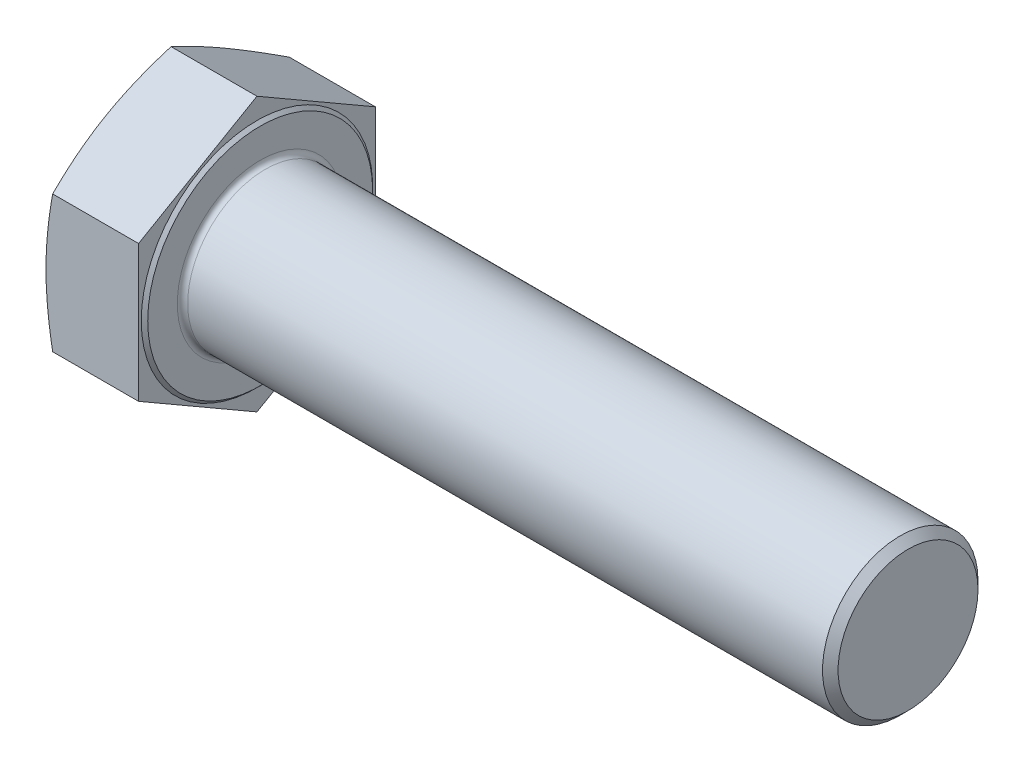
ISO-10303-21;
HEADER;
FILE_DESCRIPTION(('STEP AP214'),'2;1');
FILE_NAME('part.step','',(''),(''),'','','');
FILE_SCHEMA(('AUTOMOTIVE_DESIGN { 1 0 10303 214 1 1 1 1 }'));
ENDSEC;
DATA;
#1=APPLICATION_CONTEXT('core data for automotive mechanical design processes');
#2=APPLICATION_PROTOCOL_DEFINITION('international standard','automotive_design',2000,#1);
#3=PRODUCT_CONTEXT('',#1,'mechanical');
#4=PRODUCT('Part','Part','',(#3));
#5=PRODUCT_RELATED_PRODUCT_CATEGORY('part','',(#4));
#6=PRODUCT_DEFINITION_FORMATION('','',#4);
#7=PRODUCT_DEFINITION_CONTEXT('part definition',#1,'design');
#8=PRODUCT_DEFINITION('design','',#6,#7);
#9=PRODUCT_DEFINITION_SHAPE('','',#8);
#10=(LENGTH_UNIT() NAMED_UNIT(*) SI_UNIT(.MILLI.,.METRE.));
#11=(NAMED_UNIT(*) PLANE_ANGLE_UNIT() SI_UNIT($,.RADIAN.));
#12=(NAMED_UNIT(*) SI_UNIT($,.STERADIAN.) SOLID_ANGLE_UNIT());
#13=UNCERTAINTY_MEASURE_WITH_UNIT(LENGTH_MEASURE(1.E-05),#10,'distance_accuracy_value','');
#14=(GEOMETRIC_REPRESENTATION_CONTEXT(3) GLOBAL_UNCERTAINTY_ASSIGNED_CONTEXT((#13)) GLOBAL_UNIT_ASSIGNED_CONTEXT((#10,
#11,#12)) REPRESENTATION_CONTEXT('',''));
#15=CARTESIAN_POINT('',(0.,0.,0.));
#16=DIRECTION('',(0.,0.,1.));
#17=DIRECTION('',(1.,0.,0.));
#18=AXIS2_PLACEMENT_3D('',#15,#16,#17);
#19=CARTESIAN_POINT('',(29.58,-42.2043046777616,0.));
#20=DIRECTION('',(1.,0.,0.));
#21=DIRECTION('',(0.,0.,-1.));
#22=AXIS2_PLACEMENT_3D('',#19,#20,#21);
#23=PLANE('',#22);
#24=CARTESIAN_POINT('',(29.58,0.,0.));
#25=DIRECTION('',(1.,0.,0.));
#26=DIRECTION('',(0.,0.,-1.));
#27=AXIS2_PLACEMENT_3D('',#24,#25,#26);
#28=CIRCLE('',#27,25.6);
#29=CARTESIAN_POINT('',(29.58,0.,-25.6));
#30=VERTEX_POINT('',#29);
#31=EDGE_CURVE('E11',#30,#30,#28,.F.);
#32=ORIENTED_EDGE('',*,*,#31,.T.);
#33=EDGE_LOOP('',(#32));
#34=FACE_BOUND('',#33,.T.);
#35=CARTESIAN_POINT('',(29.58,0.,0.));
#36=DIRECTION('',(-1.,0.,0.));
#37=DIRECTION('',(0.,0.,1.));
#38=AXIS2_PLACEMENT_3D('',#35,#36,#37);
#39=CIRCLE('',#38,34.725);
#40=CARTESIAN_POINT('',(29.58,0.,34.725));
#41=VERTEX_POINT('',#40);
#42=EDGE_CURVE('E263',#41,#41,#39,.T.);
#43=ORIENTED_EDGE('',*,*,#42,.F.);
#44=EDGE_LOOP('',(#43));
#45=FACE_BOUND('',#44,.T.);
#46=ADVANCED_FACE('F32',(#34,#45),#23,.T.);
#47=CARTESIAN_POINT('',(29.58,-21.1021523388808,36.55));
#48=DIRECTION('',(0.,0.866025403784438,-0.5));
#49=DIRECTION('',(0.,0.5,0.866025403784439));
#50=AXIS2_PLACEMENT_3D('',#47,#48,#49);
#51=PLANE('',#50);
#52=CARTESIAN_POINT('',(2.05804062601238,-42.2044201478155,-0.000199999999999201));
#53=CARTESIAN_POINT('',(1.89899165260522,-41.7674273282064,0.756693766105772));
#54=CARTESIAN_POINT('',(1.74710031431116,-41.3297677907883,1.514742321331));
#55=CARTESIAN_POINT('',(1.45919661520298,-40.4531045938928,3.03316751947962));
#56=CARTESIAN_POINT('',(1.3231857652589,-40.0141008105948,3.79354437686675));
#57=CARTESIAN_POINT('',(1.06854043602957,-39.1344859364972,5.31708202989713));
#58=CARTESIAN_POINT('',(0.94991930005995,-38.6938738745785,6.08024450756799));
#59=CARTESIAN_POINT('',(0.731751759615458,-37.8114780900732,7.60859883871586));
#60=CARTESIAN_POINT('',(0.632204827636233,-37.369694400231,8.37379063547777));
#61=CARTESIAN_POINT('',(0.454493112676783,-36.4892560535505,9.89875458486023));
#62=CARTESIAN_POINT('',(0.376135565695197,-36.0506111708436,10.6585098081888));
#63=CARTESIAN_POINT('',(0.24082075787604,-35.172490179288,12.1794599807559));
#64=CARTESIAN_POINT('',(0.183863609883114,-34.7330140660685,12.9406549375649));
#65=CARTESIAN_POINT('',(0.0923403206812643,-33.8536370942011,14.4637805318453));
#66=CARTESIAN_POINT('',(0.0577660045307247,-33.4137364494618,15.225710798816));
#67=CARTESIAN_POINT('',(0.0115958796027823,-32.5336333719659,16.7500940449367));
#68=CARTESIAN_POINT('',(0.,-32.0934309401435,17.5125470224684));
#69=CARTESIAN_POINT('',(0.,-31.2130260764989,19.0374529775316));
#70=CARTESIAN_POINT('',(0.0115958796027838,-30.7728236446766,19.7999059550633));
#71=CARTESIAN_POINT('',(0.0577660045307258,-29.8927205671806,21.324289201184));
#72=CARTESIAN_POINT('',(0.0923403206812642,-29.4528199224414,22.0862194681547));
#73=CARTESIAN_POINT('',(0.183863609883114,-28.5734429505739,23.6093450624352));
#74=CARTESIAN_POINT('',(0.240820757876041,-28.1339668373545,24.3705400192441));
#75=CARTESIAN_POINT('',(0.3761355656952,-27.2558458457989,25.8914901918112));
#76=CARTESIAN_POINT('',(0.454493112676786,-26.8172009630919,26.6512454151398));
#77=CARTESIAN_POINT('',(0.632204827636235,-25.9367626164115,28.1762093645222));
#78=CARTESIAN_POINT('',(0.731751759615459,-25.4949789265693,28.9414011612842));
#79=CARTESIAN_POINT('',(0.949919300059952,-24.6125831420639,30.469755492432));
#80=CARTESIAN_POINT('',(1.06854043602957,-24.1719710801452,31.2329179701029));
#81=CARTESIAN_POINT('',(1.3231857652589,-23.2923562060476,32.7564556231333));
#82=CARTESIAN_POINT('',(1.45919661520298,-22.8533524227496,33.5168324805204));
#83=CARTESIAN_POINT('',(1.74710031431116,-21.9766892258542,35.035257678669));
#84=CARTESIAN_POINT('',(1.89899165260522,-21.5390296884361,35.7933062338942));
#85=CARTESIAN_POINT('',(2.05804062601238,-21.102036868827,36.5502));
#86=B_SPLINE_CURVE_WITH_KNOTS('',3,(#52,#53,#54,#55,#56,#57,#58,#59,#60,#61,#62,#63,#64,#65,#66,
#67,#68,#69,#70,#71,#72,#73,#74,#75,#76,#77,#78,#79,#80,#81,#82,#83,#84,#85),.UNSPECIFIED.,.F.,
.F.,(4,2,2,2,2,2,2,2,2,2,2,2,2,2,2,2,4),(0.,2.66503457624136,5.33032249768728,7.99764493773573,
10.6648936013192,13.3069924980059,15.9491053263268,18.5902526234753,21.2313917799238,
23.8725309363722,26.5136782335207,29.1557910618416,31.7978899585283,34.4651386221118,
37.1324610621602,39.7977489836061,42.4627835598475),.UNSPECIFIED.);
#87=CARTESIAN_POINT('',(2.05799859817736,-42.2043046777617,0.));
#88=VERTEX_POINT('',#87);
#89=CARTESIAN_POINT('',(0.,-31.6532285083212,18.275));
#90=VERTEX_POINT('',#89);
#91=EDGE_CURVE('E277',#88,#90,#86,.T.);
#92=ORIENTED_EDGE('',*,*,#91,.F.);
#93=DIRECTION('',(-1.,0.,0.));
#94=VECTOR('',#93,1.);
#95=CARTESIAN_POINT('',(29.58,-42.2043046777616,0.));
#96=LINE('',#95,#94);
#97=CARTESIAN_POINT('',(28.58,-42.2043046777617,0.));
#98=VERTEX_POINT('',#97);
#99=EDGE_CURVE('E142',#98,#88,#96,.T.);
#100=ORIENTED_EDGE('',*,*,#99,.F.);
#101=DIRECTION('',(0.,-0.5,-0.866025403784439));
#102=VECTOR('',#101,1.);
#103=CARTESIAN_POINT('',(28.58,-21.1021523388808,36.55));
#104=LINE('',#103,#102);
#105=CARTESIAN_POINT('',(28.58,-21.1021523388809,36.55));
#106=VERTEX_POINT('',#105);
#107=EDGE_CURVE('E133',#106,#98,#104,.T.);
#108=ORIENTED_EDGE('',*,*,#107,.F.);
#109=DIRECTION('',(-1.,0.,0.));
#110=VECTOR('',#109,1.);
#111=CARTESIAN_POINT('',(29.58,-21.1021523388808,36.55));
#112=LINE('',#111,#110);
#113=CARTESIAN_POINT('',(2.05799859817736,-21.1021523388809,36.55));
#114=VERTEX_POINT('',#113);
#115=EDGE_CURVE('E128',#106,#114,#112,.T.);
#116=ORIENTED_EDGE('',*,*,#115,.T.);
#117=EDGE_CURVE('E121',#90,#114,#86,.T.);
#118=ORIENTED_EDGE('',*,*,#117,.F.);
#119=EDGE_LOOP('',(#92,#100,#108,#116,#118));
#120=FACE_BOUND('',#119,.T.);
#121=ADVANCED_FACE('F34',(#120),#51,.F.);
#122=CARTESIAN_POINT('',(29.58,-42.2043046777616,0.));
#123=DIRECTION('',(0.,0.866025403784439,0.5));
#124=DIRECTION('',(0.,-0.5,0.866025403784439));
#125=AXIS2_PLACEMENT_3D('',#122,#123,#124);
#126=PLANE('',#125);
#127=CARTESIAN_POINT('',(2.05804062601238,-21.102036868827,-36.5502));
#128=CARTESIAN_POINT('',(1.89899165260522,-21.5390296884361,-35.7933062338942));
#129=CARTESIAN_POINT('',(1.74710031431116,-21.9766892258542,-35.035257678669));
#130=CARTESIAN_POINT('',(1.45919661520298,-22.8533524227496,-33.5168324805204));
#131=CARTESIAN_POINT('',(1.3231857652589,-23.2923562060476,-32.7564556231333));
#132=CARTESIAN_POINT('',(1.06854043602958,-24.1719710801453,-31.2329179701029));
#133=CARTESIAN_POINT('',(0.949919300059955,-24.6125831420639,-30.469755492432));
#134=CARTESIAN_POINT('',(0.731751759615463,-25.4949789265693,-28.9414011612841));
#135=CARTESIAN_POINT('',(0.632204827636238,-25.9367626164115,-28.1762093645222));
#136=CARTESIAN_POINT('',(0.454493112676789,-26.8172009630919,-26.6512454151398));
#137=CARTESIAN_POINT('',(0.376135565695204,-27.2558458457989,-25.8914901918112));
#138=CARTESIAN_POINT('',(0.240820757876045,-28.1339668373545,-24.3705400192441));
#139=CARTESIAN_POINT('',(0.183863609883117,-28.573442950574,-23.6093450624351));
#140=CARTESIAN_POINT('',(0.0923403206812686,-29.4528199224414,-22.0862194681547));
#141=CARTESIAN_POINT('',(0.0577660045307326,-29.8927205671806,-21.324289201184));
#142=CARTESIAN_POINT('',(0.0115958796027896,-30.7728236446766,-19.7999059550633));
#143=CARTESIAN_POINT('',(0.,-31.2130260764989,-19.0374529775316));
#144=CARTESIAN_POINT('',(0.,-32.0934309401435,-17.5125470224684));
#145=CARTESIAN_POINT('',(0.0115958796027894,-32.5336333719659,-16.7500940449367));
#146=CARTESIAN_POINT('',(0.0577660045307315,-33.4137364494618,-15.225710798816));
#147=CARTESIAN_POINT('',(0.0923403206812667,-33.8536370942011,-14.4637805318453));
#148=CARTESIAN_POINT('',(0.183863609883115,-34.7330140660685,-12.9406549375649));
#149=CARTESIAN_POINT('',(0.240820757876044,-35.172490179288,-12.1794599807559));
#150=CARTESIAN_POINT('',(0.376135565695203,-36.0506111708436,-10.6585098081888));
#151=CARTESIAN_POINT('',(0.454493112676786,-36.4892560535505,-9.89875458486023));
#152=CARTESIAN_POINT('',(0.632204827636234,-37.369694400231,-8.37379063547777));
#153=CARTESIAN_POINT('',(0.73175175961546,-37.8114780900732,-7.60859883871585));
#154=CARTESIAN_POINT('',(0.949919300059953,-38.6938738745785,-6.08024450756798));
#155=CARTESIAN_POINT('',(1.06854043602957,-39.1344859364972,-5.31708202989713));
#156=CARTESIAN_POINT('',(1.3231857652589,-40.0141008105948,-3.79354437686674));
#157=CARTESIAN_POINT('',(1.45919661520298,-40.4531045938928,-3.03316751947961));
#158=CARTESIAN_POINT('',(1.74710031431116,-41.3297677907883,-1.51474232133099));
#159=CARTESIAN_POINT('',(1.89899165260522,-41.7674273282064,-0.756693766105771));
#160=CARTESIAN_POINT('',(2.05804062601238,-42.2044201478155,0.000199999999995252));
#161=B_SPLINE_CURVE_WITH_KNOTS('',3,(#127,#128,#129,#130,#131,#132,#133,#134,#135,#136,#137,
#138,#139,#140,#141,#142,#143,#144,#145,#146,#147,#148,#149,#150,#151,#152,#153,#154,#155,#156,
#157,#158,#159,#160),.UNSPECIFIED.,.F.,.F.,(4,2,2,2,2,2,2,2,2,2,2,2,2,2,2,2,4),(0.,
2.66503457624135,5.33032249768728,7.99764493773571,10.6648936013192,13.3069924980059,
15.9491053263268,18.5902526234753,21.2313917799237,23.8725309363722,26.5136782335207,
29.1557910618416,31.7978899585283,34.4651386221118,37.1324610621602,39.7977489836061,
42.4627835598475),.UNSPECIFIED.);
#162=CARTESIAN_POINT('',(2.05799859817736,-21.1021523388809,-36.55));
#163=VERTEX_POINT('',#162);
#164=CARTESIAN_POINT('',(0.,-31.6532285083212,-18.275));
#165=VERTEX_POINT('',#164);
#166=EDGE_CURVE('E230',#163,#165,#161,.T.);
#167=ORIENTED_EDGE('',*,*,#166,.F.);
#168=DIRECTION('',(-1.,0.,0.));
#169=VECTOR('',#168,1.);
#170=CARTESIAN_POINT('',(29.58,-21.1021523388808,-36.55));
#171=LINE('',#170,#169);
#172=CARTESIAN_POINT('',(28.58,-21.1021523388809,-36.55));
#173=VERTEX_POINT('',#172);
#174=EDGE_CURVE('E139',#173,#163,#171,.T.);
#175=ORIENTED_EDGE('',*,*,#174,.F.);
#176=DIRECTION('',(0.,0.5,-0.866025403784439));
#177=VECTOR('',#176,1.);
#178=CARTESIAN_POINT('',(28.58,-42.2043046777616,0.));
#179=LINE('',#178,#177);
#180=EDGE_CURVE('E267',#98,#173,#179,.T.);
#181=ORIENTED_EDGE('',*,*,#180,.F.);
#182=ORIENTED_EDGE('',*,*,#99,.T.);
#183=EDGE_CURVE('E226',#165,#88,#161,.T.);
#184=ORIENTED_EDGE('',*,*,#183,.F.);
#185=EDGE_LOOP('',(#167,#175,#181,#182,#184));
#186=FACE_BOUND('',#185,.T.);
#187=ADVANCED_FACE('F180',(#186),#126,.F.);
#188=CARTESIAN_POINT('',(29.58,-21.1021523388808,-36.55));
#189=DIRECTION('',(0.,0.,1.));
#190=DIRECTION('',(1.,0.,0.));
#191=AXIS2_PLACEMENT_3D('',#188,#189,#190);
#192=PLANE('',#191);
#193=CARTESIAN_POINT('',(10.997128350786,-55.8710793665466,-36.55));
#194=CARTESIAN_POINT('',(10.7453007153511,-55.0442647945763,-36.55));
#195=CARTESIAN_POINT('',(10.4949923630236,-54.2169860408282,-36.55));
#196=CARTESIAN_POINT('',(9.99776250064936,-52.561406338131,-36.55));
#197=CARTESIAN_POINT('',(9.75084101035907,-51.7331053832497,-36.55));
#198=CARTESIAN_POINT('',(9.26071704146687,-50.0753326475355,-36.55));
#199=CARTESIAN_POINT('',(9.01751485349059,-49.2458607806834,-36.55));
#200=CARTESIAN_POINT('',(8.53526185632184,-47.5857132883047,-36.55));
#201=CARTESIAN_POINT('',(8.29621104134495,-46.7550376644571,-36.55));
#202=CARTESIAN_POINT('',(7.58506840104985,-44.2579394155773,-36.55));
#203=CARTESIAN_POINT('',(7.11990294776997,-42.5895336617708,-36.55));
#204=CARTESIAN_POINT('',(6.21245462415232,-39.246522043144,-36.55));
#205=CARTESIAN_POINT('',(5.77017134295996,-37.571916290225,-36.55));
#206=CARTESIAN_POINT('',(4.91945035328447,-34.236073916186,-36.55));
#207=CARTESIAN_POINT('',(4.51066258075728,-32.5749270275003,-36.55));
#208=CARTESIAN_POINT('',(3.72788941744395,-29.2443687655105,-36.55));
#209=CARTESIAN_POINT('',(3.3539046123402,-27.5749572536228,-36.55));
#210=CARTESIAN_POINT('',(2.64945845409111,-24.2274901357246,-36.55));
#211=CARTESIAN_POINT('',(2.31898225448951,-22.5494376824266,-36.55));
#212=CARTESIAN_POINT('',(1.71161271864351,-19.1836068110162,-36.55));
#213=CARTESIAN_POINT('',(1.43471758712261,-17.4958287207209,-36.55));
#214=CARTESIAN_POINT('',(0.973187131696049,-14.3005235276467,-36.55));
#215=CARTESIAN_POINT('',(0.781688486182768,-12.7940033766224,-36.55));
#216=CARTESIAN_POINT('',(0.538540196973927,-10.5295267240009,-36.55));
#217=CARTESIAN_POINT('',(0.464839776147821,-9.77390467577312,-36.55));
#218=CARTESIAN_POINT('',(0.33296808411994,-8.26131371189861,-36.55));
#219=CARTESIAN_POINT('',(0.274796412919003,-7.50434483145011,-36.55));
#220=CARTESIAN_POINT('',(0.174734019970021,-5.98985143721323,-36.55));
#221=CARTESIAN_POINT('',(0.132832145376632,-5.23232766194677,-36.55));
#222=CARTESIAN_POINT('',(0.0657938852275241,-3.71653556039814,-36.55));
#223=CARTESIAN_POINT('',(0.040657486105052,-2.95826723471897,-36.55));
#224=CARTESIAN_POINT('',(0.00748816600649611,-1.44135786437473,-36.55));
#225=CARTESIAN_POINT('',(-0.000544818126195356,-0.682716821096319,-36.55));
#226=CARTESIAN_POINT('',(0.00060221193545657,0.834552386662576,-36.55));
#227=CARTESIAN_POINT('',(0.00978223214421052,1.59318055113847,-36.55));
#228=CARTESIAN_POINT('',(0.0453198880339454,3.11388010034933,-36.55));
#229=CARTESIAN_POINT('',(0.0717643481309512,3.87594944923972,-36.55));
#230=CARTESIAN_POINT('',(0.141556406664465,5.39931025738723,-36.55));
#231=CARTESIAN_POINT('',(0.184904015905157,6.16060171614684,-36.55));
#232=CARTESIAN_POINT('',(0.287938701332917,7.68207701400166,-36.55));
#233=CARTESIAN_POINT('',(0.34762580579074,8.44226085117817,-36.55));
#234=CARTESIAN_POINT('',(0.482600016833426,9.96124931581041,-36.55));
#235=CARTESIAN_POINT('',(0.557887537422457,10.7200539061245,-36.55));
#236=CARTESIAN_POINT('',(0.80601087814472,12.995295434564,-36.55));
#237=CARTESIAN_POINT('',(1.00102300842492,14.5093503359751,-36.55));
#238=CARTESIAN_POINT('',(1.4423191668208,17.5298342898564,-36.55));
#239=CARTESIAN_POINT('',(1.68860346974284,19.0362633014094,-36.55));
#240=CARTESIAN_POINT('',(2.23859081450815,22.1208313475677,-36.55));
#241=CARTESIAN_POINT('',(2.54464193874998,23.6985486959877,-36.55));
#242=CARTESIAN_POINT('',(3.19613542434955,26.8458774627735,-36.55));
#243=CARTESIAN_POINT('',(3.54158075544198,28.4154882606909,-36.55));
#244=CARTESIAN_POINT('',(4.26460826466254,31.5477274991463,-36.55));
#245=CARTESIAN_POINT('',(4.6421997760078,33.1103537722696,-36.55));
#246=CARTESIAN_POINT('',(5.42337754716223,36.2290233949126,-36.55));
#247=CARTESIAN_POINT('',(5.82696318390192,37.7850669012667,-36.55));
#248=CARTESIAN_POINT('',(6.65580214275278,40.893492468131,-36.55));
#249=CARTESIAN_POINT('',(7.08108262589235,42.4458672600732,-36.55));
#250=CARTESIAN_POINT('',(7.94894356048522,45.5457668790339,-36.55));
#251=CARTESIAN_POINT('',(8.39152408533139,47.0932916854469,-36.55));
#252=CARTESIAN_POINT('',(9.29081863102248,50.1839386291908,-36.55));
#253=CARTESIAN_POINT('',(9.74753026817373,51.727061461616,-36.55));
#254=CARTESIAN_POINT('',(10.6727024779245,54.8097715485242,-36.55));
#255=CARTESIAN_POINT('',(11.1411630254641,56.3493588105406,-36.55));
#256=CARTESIAN_POINT('',(12.0826499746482,59.4085344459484,-36.55));
#257=CARTESIAN_POINT('',(12.5555688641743,60.9281559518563,-36.55));
#258=CARTESIAN_POINT('',(13.5094624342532,63.9648660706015,-36.55));
#259=CARTESIAN_POINT('',(13.9904371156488,65.4819546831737,-36.55));
#260=CARTESIAN_POINT('',(14.9592324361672,68.5140192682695,-36.55));
#261=CARTESIAN_POINT('',(15.4470533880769,70.0289951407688,-36.55));
#262=CARTESIAN_POINT('',(16.4285161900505,73.0570605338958,-36.55));
#263=CARTESIAN_POINT('',(16.9221580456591,74.5701500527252,-36.55));
#264=CARTESIAN_POINT('',(17.9125546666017,77.5889485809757,-36.55));
#265=CARTESIAN_POINT('',(18.4092905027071,79.0946638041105,-36.55));
#266=CARTESIAN_POINT('',(19.4070486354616,82.1046736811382,-36.55));
#267=CARTESIAN_POINT('',(19.908070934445,83.608968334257,-36.55));
#268=CARTESIAN_POINT('',(20.9137958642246,86.6161893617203,-36.55));
#269=CARTESIAN_POINT('',(21.4184981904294,88.1191158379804,-36.55));
#270=CARTESIAN_POINT('',(22.4311686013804,91.1238642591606,-36.55));
#271=CARTESIAN_POINT('',(22.9391366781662,92.625686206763,-36.55));
#272=CARTESIAN_POINT('',(23.4485112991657,94.1270297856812,-36.55));
#273=B_SPLINE_CURVE_WITH_KNOTS('',3,(#193,#194,#195,#196,#197,#198,#199,#200,#201,#202,#203,
#204,#205,#206,#207,#208,#209,#210,#211,#212,#213,#214,#215,#216,#217,#218,#219,#220,#221,#222,
#223,#224,#225,#226,#227,#228,#229,#230,#231,#232,#233,#234,#235,#236,#237,#238,#239,#240,#241,
#242,#243,#244,#245,#246,#247,#248,#249,#250,#251,#252,#253,#254,#255,#256,#257,#258,#259,#260,
#261,#262,#263,#264,#265,#266,#267,#268,#269,#270,#271,#272),.UNSPECIFIED.,.F.,.F.,(4,2,2,2,2,2,
2,2,2,2,2,2,2,2,2,2,2,2,2,2,2,2,2,2,2,2,2,2,2,2,2,2,2,2,2,2,2,2,2,4),(0.,2.59294388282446,
5.18590288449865,7.77906347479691,10.3722204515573,15.5681981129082,20.7640824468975,
25.8959042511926,31.0278124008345,36.157964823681,41.2879453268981,45.8427572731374,
48.1202459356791,50.3976759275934,52.6735419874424,54.9494062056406,57.2252620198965,
59.5011186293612,61.7885098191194,64.0759024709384,66.3632990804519,68.6507564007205,
73.2293066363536,77.8078814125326,82.6286387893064,87.4497598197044,92.2722854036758,
97.0946954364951,101.923298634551,106.751922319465,111.579735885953,116.407539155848,
121.182040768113,125.956542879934,130.731263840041,135.505989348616,140.262590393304,
145.019194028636,149.775408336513,154.531611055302),.UNSPECIFIED.);
#274=CARTESIAN_POINT('',(2.05799859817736,21.1021523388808,-36.55));
#275=VERTEX_POINT('',#274);
#276=CARTESIAN_POINT('',(0.,0.,-36.55));
#277=VERTEX_POINT('',#276);
#278=EDGE_CURVE('E293',#275,#277,#273,.F.);
#279=ORIENTED_EDGE('',*,*,#278,.F.);
#280=DIRECTION('',(-1.,0.,0.));
#281=VECTOR('',#280,1.);
#282=CARTESIAN_POINT('',(29.58,21.1021523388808,-36.55));
#283=LINE('',#282,#281);
#284=CARTESIAN_POINT('',(28.58,21.1021523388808,-36.55));
#285=VERTEX_POINT('',#284);
#286=EDGE_CURVE('E130',#285,#275,#283,.T.);
#287=ORIENTED_EDGE('',*,*,#286,.F.);
#288=DIRECTION('',(0.,1.,0.));
#289=VECTOR('',#288,1.);
#290=CARTESIAN_POINT('',(28.58,-21.1021523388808,-36.55));
#291=LINE('',#290,#289);
#292=EDGE_CURVE('E260',#173,#285,#291,.T.);
#293=ORIENTED_EDGE('',*,*,#292,.F.);
#294=ORIENTED_EDGE('',*,*,#174,.T.);
#295=EDGE_CURVE('E231',#277,#163,#273,.F.);
#296=ORIENTED_EDGE('',*,*,#295,.F.);
#297=EDGE_LOOP('',(#279,#287,#293,#294,#296));
#298=FACE_BOUND('',#297,.T.);
#299=ADVANCED_FACE('F239',(#298),#192,.F.);
#300=CARTESIAN_POINT('',(29.58,21.1021523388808,-36.55));
#301=DIRECTION('',(0.,-0.866025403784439,0.5));
#302=DIRECTION('',(0.,-0.5,-0.866025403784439));
#303=AXIS2_PLACEMENT_3D('',#300,#301,#302);
#304=PLANE('',#303);
#305=CARTESIAN_POINT('',(2.05804062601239,42.2044201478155,0.00020000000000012));
#306=CARTESIAN_POINT('',(1.89899165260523,41.7674273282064,-0.756693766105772));
#307=CARTESIAN_POINT('',(1.74710031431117,41.3297677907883,-1.514742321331));
#308=CARTESIAN_POINT('',(1.45919661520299,40.4531045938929,-3.03316751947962));
#309=CARTESIAN_POINT('',(1.32318576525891,40.0141008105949,-3.79354437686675));
#310=CARTESIAN_POINT('',(1.06854043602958,39.1344859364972,-5.31708202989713));
#311=CARTESIAN_POINT('',(0.949919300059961,38.6938738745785,-6.08024450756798));
#312=CARTESIAN_POINT('',(0.731751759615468,37.8114780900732,-7.60859883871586));
#313=CARTESIAN_POINT('',(0.632204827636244,37.369694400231,-8.37379063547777));
#314=CARTESIAN_POINT('',(0.454493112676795,36.4892560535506,-9.89875458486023));
#315=CARTESIAN_POINT('',(0.37613556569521,36.0506111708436,-10.6585098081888));
#316=CARTESIAN_POINT('',(0.240820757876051,35.172490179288,-12.1794599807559));
#317=CARTESIAN_POINT('',(0.183863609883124,34.7330140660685,-12.9406549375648));
#318=CARTESIAN_POINT('',(0.0923403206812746,33.8536370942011,-14.4637805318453));
#319=CARTESIAN_POINT('',(0.0577660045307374,33.4137364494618,-15.225710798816));
#320=CARTESIAN_POINT('',(0.0115958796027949,32.5336333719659,-16.7500940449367));
#321=CARTESIAN_POINT('',(0.,32.0934309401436,-17.5125470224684));
#322=CARTESIAN_POINT('',(0.,31.2130260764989,-19.0374529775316));
#323=CARTESIAN_POINT('',(0.0115958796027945,30.7728236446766,-19.7999059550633));
#324=CARTESIAN_POINT('',(0.0577660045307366,29.8927205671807,-21.324289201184));
#325=CARTESIAN_POINT('',(0.0923403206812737,29.4528199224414,-22.0862194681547));
#326=CARTESIAN_POINT('',(0.183863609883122,28.573442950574,-23.6093450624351));
#327=CARTESIAN_POINT('',(0.240820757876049,28.1339668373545,-24.3705400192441));
#328=CARTESIAN_POINT('',(0.376135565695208,27.2558458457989,-25.8914901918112));
#329=CARTESIAN_POINT('',(0.454493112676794,26.8172009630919,-26.6512454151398));
#330=CARTESIAN_POINT('',(0.632204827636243,25.9367626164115,-28.1762093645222));
#331=CARTESIAN_POINT('',(0.731751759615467,25.4949789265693,-28.9414011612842));
#332=CARTESIAN_POINT('',(0.949919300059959,24.612583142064,-30.469755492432));
#333=CARTESIAN_POINT('',(1.06854043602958,24.1719710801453,-31.2329179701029));
#334=CARTESIAN_POINT('',(1.32318576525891,23.2923562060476,-32.7564556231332));
#335=CARTESIAN_POINT('',(1.45919661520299,22.8533524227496,-33.5168324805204));
#336=CARTESIAN_POINT('',(1.74710031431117,21.9766892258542,-35.035257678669));
#337=CARTESIAN_POINT('',(1.89899165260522,21.5390296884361,-35.7933062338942));
#338=CARTESIAN_POINT('',(2.05804062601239,21.102036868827,-36.5502));
#339=B_SPLINE_CURVE_WITH_KNOTS('',3,(#305,#306,#307,#308,#309,#310,#311,#312,#313,#314,#315,
#316,#317,#318,#319,#320,#321,#322,#323,#324,#325,#326,#327,#328,#329,#330,#331,#332,#333,#334,
#335,#336,#337,#338),.UNSPECIFIED.,.F.,.F.,(4,2,2,2,2,2,2,2,2,2,2,2,2,2,2,2,4),(0.,
2.66503457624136,5.33032249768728,7.99764493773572,10.6648936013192,13.3069924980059,
15.9491053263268,18.5902526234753,21.2313917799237,23.8725309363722,26.5136782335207,
29.1557910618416,31.7978899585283,34.4651386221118,37.1324610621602,39.7977489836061,
42.4627835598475),.UNSPECIFIED.);
#340=CARTESIAN_POINT('',(2.05799859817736,42.2043046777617,0.));
#341=VERTEX_POINT('',#340);
#342=CARTESIAN_POINT('',(0.,31.6532285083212,-18.275));
#343=VERTEX_POINT('',#342);
#344=EDGE_CURVE('E48',#341,#343,#339,.T.);
#345=ORIENTED_EDGE('',*,*,#344,.F.);
#346=DIRECTION('',(-1.,0.,0.));
#347=VECTOR('',#346,1.);
#348=CARTESIAN_POINT('',(29.58,42.2043046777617,0.));
#349=LINE('',#348,#347);
#350=CARTESIAN_POINT('',(28.58,42.2043046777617,0.));
#351=VERTEX_POINT('',#350);
#352=EDGE_CURVE('E127',#351,#341,#349,.T.);
#353=ORIENTED_EDGE('',*,*,#352,.F.);
#354=DIRECTION('',(0.,0.5,0.866025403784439));
#355=VECTOR('',#354,1.);
#356=CARTESIAN_POINT('',(28.58,21.1021523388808,-36.55));
#357=LINE('',#356,#355);
#358=EDGE_CURVE('E257',#285,#351,#357,.T.);
#359=ORIENTED_EDGE('',*,*,#358,.F.);
#360=ORIENTED_EDGE('',*,*,#286,.T.);
#361=EDGE_CURVE('E254',#343,#275,#339,.T.);
#362=ORIENTED_EDGE('',*,*,#361,.F.);
#363=EDGE_LOOP('',(#345,#353,#359,#360,#362));
#364=FACE_BOUND('',#363,.T.);
#365=ADVANCED_FACE('F243',(#364),#304,.F.);
#366=CARTESIAN_POINT('',(29.58,42.2043046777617,0.));
#367=DIRECTION('',(0.,-0.866025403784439,-0.5));
#368=DIRECTION('',(0.,0.5,-0.866025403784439));
#369=AXIS2_PLACEMENT_3D('',#366,#367,#368);
#370=PLANE('',#369);
#371=CARTESIAN_POINT('',(2.05804062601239,21.102036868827,36.5502));
#372=CARTESIAN_POINT('',(1.89899165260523,21.5390296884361,35.7933062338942));
#373=CARTESIAN_POINT('',(1.74710031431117,21.9766892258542,35.035257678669));
#374=CARTESIAN_POINT('',(1.45919661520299,22.8533524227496,33.5168324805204));
#375=CARTESIAN_POINT('',(1.32318576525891,23.2923562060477,32.7564556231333));
#376=CARTESIAN_POINT('',(1.06854043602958,24.1719710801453,31.2329179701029));
#377=CARTESIAN_POINT('',(0.949919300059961,24.612583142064,30.469755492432));
#378=CARTESIAN_POINT('',(0.731751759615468,25.4949789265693,28.9414011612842));
#379=CARTESIAN_POINT('',(0.632204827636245,25.9367626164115,28.1762093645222));
#380=CARTESIAN_POINT('',(0.454493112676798,26.8172009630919,26.6512454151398));
#381=CARTESIAN_POINT('',(0.376135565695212,27.2558458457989,25.8914901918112));
#382=CARTESIAN_POINT('',(0.240820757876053,28.1339668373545,24.3705400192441));
#383=CARTESIAN_POINT('',(0.183863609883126,28.573442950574,23.6093450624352));
#384=CARTESIAN_POINT('',(0.0923403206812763,29.4528199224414,22.0862194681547));
#385=CARTESIAN_POINT('',(0.0577660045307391,29.8927205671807,21.324289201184));
#386=CARTESIAN_POINT('',(0.011595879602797,30.7728236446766,19.7999059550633));
#387=CARTESIAN_POINT('',(0.,31.2130260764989,19.0374529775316));
#388=CARTESIAN_POINT('',(0.,32.0934309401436,17.5125470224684));
#389=CARTESIAN_POINT('',(0.0115958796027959,32.5336333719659,16.7500940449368));
#390=CARTESIAN_POINT('',(0.057766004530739,33.4137364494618,15.225710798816));
#391=CARTESIAN_POINT('',(0.092340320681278,33.8536370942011,14.4637805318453));
#392=CARTESIAN_POINT('',(0.183863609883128,34.7330140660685,12.9406549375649));
#393=CARTESIAN_POINT('',(0.240820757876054,35.172490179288,12.1794599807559));
#394=CARTESIAN_POINT('',(0.376135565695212,36.0506111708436,10.6585098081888));
#395=CARTESIAN_POINT('',(0.454493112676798,36.4892560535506,9.89875458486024));
#396=CARTESIAN_POINT('',(0.632204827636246,37.369694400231,8.37379063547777));
#397=CARTESIAN_POINT('',(0.731751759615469,37.8114780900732,7.60859883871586));
#398=CARTESIAN_POINT('',(0.949919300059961,38.6938738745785,6.08024450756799));
#399=CARTESIAN_POINT('',(1.06854043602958,39.1344859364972,5.31708202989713));
#400=CARTESIAN_POINT('',(1.32318576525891,40.0141008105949,3.79354437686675));
#401=CARTESIAN_POINT('',(1.45919661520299,40.4531045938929,3.03316751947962));
#402=CARTESIAN_POINT('',(1.74710031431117,41.3297677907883,1.514742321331));
#403=CARTESIAN_POINT('',(1.89899165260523,41.7674273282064,0.756693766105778));
#404=CARTESIAN_POINT('',(2.05804062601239,42.2044201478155,-0.000199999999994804));
#405=B_SPLINE_CURVE_WITH_KNOTS('',3,(#371,#372,#373,#374,#375,#376,#377,#378,#379,#380,#381,
#382,#383,#384,#385,#386,#387,#388,#389,#390,#391,#392,#393,#394,#395,#396,#397,#398,#399,#400,
#401,#402,#403,#404),.UNSPECIFIED.,.F.,.F.,(4,2,2,2,2,2,2,2,2,2,2,2,2,2,2,2,4),(0.,
2.66503457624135,5.33032249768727,7.99764493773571,10.6648936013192,13.3069924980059,
15.9491053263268,18.5902526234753,21.2313917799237,23.8725309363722,26.5136782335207,
29.1557910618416,31.7978899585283,34.4651386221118,37.1324610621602,39.7977489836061,
42.4627835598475),.UNSPECIFIED.);
#406=CARTESIAN_POINT('',(2.05799859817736,21.1021523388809,36.55));
#407=VERTEX_POINT('',#406);
#408=CARTESIAN_POINT('',(0.,31.6532285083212,18.275));
#409=VERTEX_POINT('',#408);
#410=EDGE_CURVE('E56',#407,#409,#405,.T.);
#411=ORIENTED_EDGE('',*,*,#410,.F.);
#412=DIRECTION('',(-1.,0.,0.));
#413=VECTOR('',#412,1.);
#414=CARTESIAN_POINT('',(29.58,21.1021523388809,36.55));
#415=LINE('',#414,#413);
#416=CARTESIAN_POINT('',(28.58,21.1021523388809,36.55));
#417=VERTEX_POINT('',#416);
#418=EDGE_CURVE('E118',#417,#407,#415,.T.);
#419=ORIENTED_EDGE('',*,*,#418,.F.);
#420=DIRECTION('',(0.,-0.5,0.866025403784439));
#421=VECTOR('',#420,1.);
#422=CARTESIAN_POINT('',(28.58,42.2043046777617,0.));
#423=LINE('',#422,#421);
#424=EDGE_CURVE('E255',#351,#417,#423,.T.);
#425=ORIENTED_EDGE('',*,*,#424,.F.);
#426=ORIENTED_EDGE('',*,*,#352,.T.);
#427=EDGE_CURVE('E120',#409,#341,#405,.T.);
#428=ORIENTED_EDGE('',*,*,#427,.F.);
#429=EDGE_LOOP('',(#411,#419,#425,#426,#428));
#430=FACE_BOUND('',#429,.T.);
#431=ADVANCED_FACE('F116',(#430),#370,.F.);
#432=CARTESIAN_POINT('',(29.58,21.1021523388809,36.55));
#433=DIRECTION('',(0.,0.,-1.));
#434=DIRECTION('',(-1.,0.,0.));
#435=AXIS2_PLACEMENT_3D('',#432,#433,#434);
#436=PLANE('',#435);
#437=CARTESIAN_POINT('',(10.997128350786,-55.8710793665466,36.55));
#438=CARTESIAN_POINT('',(10.7453007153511,-55.0442647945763,36.55));
#439=CARTESIAN_POINT('',(10.4949923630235,-54.2169860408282,36.55));
#440=CARTESIAN_POINT('',(9.99776250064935,-52.5614063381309,36.55));
#441=CARTESIAN_POINT('',(9.75084101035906,-51.7331053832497,36.55));
#442=CARTESIAN_POINT('',(9.26071704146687,-50.0753326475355,36.55));
#443=CARTESIAN_POINT('',(9.01751485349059,-49.2458607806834,36.55));
#444=CARTESIAN_POINT('',(8.53526185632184,-47.5857132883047,36.55));
#445=CARTESIAN_POINT('',(8.29621104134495,-46.7550376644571,36.55));
#446=CARTESIAN_POINT('',(7.58506840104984,-44.2579394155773,36.55));
#447=CARTESIAN_POINT('',(7.11990294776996,-42.5895336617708,36.55));
#448=CARTESIAN_POINT('',(6.21245462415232,-39.246522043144,36.55));
#449=CARTESIAN_POINT('',(5.77017134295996,-37.571916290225,36.55));
#450=CARTESIAN_POINT('',(4.91945035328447,-34.236073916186,36.55));
#451=CARTESIAN_POINT('',(4.51066258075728,-32.5749270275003,36.55));
#452=CARTESIAN_POINT('',(3.72788941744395,-29.2443687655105,36.55));
#453=CARTESIAN_POINT('',(3.3539046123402,-27.5749572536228,36.55));
#454=CARTESIAN_POINT('',(2.64945845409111,-24.2274901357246,36.55));
#455=CARTESIAN_POINT('',(2.31898225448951,-22.5494376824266,36.55));
#456=CARTESIAN_POINT('',(1.71161271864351,-19.1836068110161,36.55));
#457=CARTESIAN_POINT('',(1.4347175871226,-17.4958287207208,36.55));
#458=CARTESIAN_POINT('',(0.973187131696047,-14.3005235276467,36.55));
#459=CARTESIAN_POINT('',(0.781688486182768,-12.7940033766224,36.55));
#460=CARTESIAN_POINT('',(0.538540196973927,-10.5295267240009,36.55));
#461=CARTESIAN_POINT('',(0.464839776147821,-9.77390467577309,36.55));
#462=CARTESIAN_POINT('',(0.332968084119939,-8.26131371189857,36.55));
#463=CARTESIAN_POINT('',(0.274796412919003,-7.50434483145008,36.55));
#464=CARTESIAN_POINT('',(0.174734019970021,-5.98985143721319,36.55));
#465=CARTESIAN_POINT('',(0.132832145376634,-5.23232766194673,36.55));
#466=CARTESIAN_POINT('',(0.0657938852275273,-3.7165355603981,36.55));
#467=CARTESIAN_POINT('',(0.0406574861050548,-2.95826723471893,36.55));
#468=CARTESIAN_POINT('',(0.00748816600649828,-1.44135786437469,36.55));
#469=CARTESIAN_POINT('',(-0.000544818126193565,-0.682716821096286,36.55));
#470=CARTESIAN_POINT('',(0.000602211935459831,0.834552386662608,36.55));
#471=CARTESIAN_POINT('',(0.00978223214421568,1.5931805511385,36.55));
#472=CARTESIAN_POINT('',(0.0453198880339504,3.11388010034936,36.55));
#473=CARTESIAN_POINT('',(0.071764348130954,3.87594944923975,36.55));
#474=CARTESIAN_POINT('',(0.141556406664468,5.39931025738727,36.55));
#475=CARTESIAN_POINT('',(0.184904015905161,6.16060171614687,36.55));
#476=CARTESIAN_POINT('',(0.287938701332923,7.6820770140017,36.55));
#477=CARTESIAN_POINT('',(0.347625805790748,8.44226085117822,36.55));
#478=CARTESIAN_POINT('',(0.482600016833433,9.96124931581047,36.55));
#479=CARTESIAN_POINT('',(0.557887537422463,10.7200539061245,36.55));
#480=CARTESIAN_POINT('',(0.806010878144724,12.9952954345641,36.55));
#481=CARTESIAN_POINT('',(1.00102300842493,14.5093503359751,36.55));
#482=CARTESIAN_POINT('',(1.44231916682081,17.5298342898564,36.55));
#483=CARTESIAN_POINT('',(1.68860346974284,19.0362633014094,36.55));
#484=CARTESIAN_POINT('',(2.23859081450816,22.1208313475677,36.55));
#485=CARTESIAN_POINT('',(2.54464193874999,23.6985486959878,36.55));
#486=CARTESIAN_POINT('',(3.19613542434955,26.8458774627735,36.55));
#487=CARTESIAN_POINT('',(3.54158075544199,28.4154882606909,36.55));
#488=CARTESIAN_POINT('',(4.26460826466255,31.5477274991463,36.55));
#489=CARTESIAN_POINT('',(4.6421997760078,33.1103537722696,36.55));
#490=CARTESIAN_POINT('',(5.42337754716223,36.2290233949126,36.55));
#491=CARTESIAN_POINT('',(5.82696318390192,37.7850669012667,36.55));
#492=CARTESIAN_POINT('',(6.65580214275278,40.893492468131,36.55));
#493=CARTESIAN_POINT('',(7.08108262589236,42.4458672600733,36.55));
#494=CARTESIAN_POINT('',(7.94894356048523,45.5457668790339,36.55));
#495=CARTESIAN_POINT('',(8.39152408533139,47.0932916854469,36.55));
#496=CARTESIAN_POINT('',(9.29081863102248,50.1839386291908,36.55));
#497=CARTESIAN_POINT('',(9.74753026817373,51.727061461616,36.55));
#498=CARTESIAN_POINT('',(10.6727024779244,54.8097715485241,36.55));
#499=CARTESIAN_POINT('',(11.1411630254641,56.3493588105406,36.55));
#500=CARTESIAN_POINT('',(12.0826499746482,59.4085344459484,36.55));
#501=CARTESIAN_POINT('',(12.5555688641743,60.9281559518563,36.55));
#502=CARTESIAN_POINT('',(13.5094624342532,63.9648660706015,36.55));
#503=CARTESIAN_POINT('',(13.9904371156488,65.4819546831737,36.55));
#504=CARTESIAN_POINT('',(14.9592324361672,68.5140192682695,36.55));
#505=CARTESIAN_POINT('',(15.4470533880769,70.0289951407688,36.55));
#506=CARTESIAN_POINT('',(16.4285161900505,73.0570605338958,36.55));
#507=CARTESIAN_POINT('',(16.9221580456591,74.5701500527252,36.55));
#508=CARTESIAN_POINT('',(17.9125546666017,77.5889485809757,36.55));
#509=CARTESIAN_POINT('',(18.4092905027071,79.0946638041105,36.55));
#510=CARTESIAN_POINT('',(19.4070486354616,82.1046736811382,36.55));
#511=CARTESIAN_POINT('',(19.908070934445,83.608968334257,36.55));
#512=CARTESIAN_POINT('',(20.9137958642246,86.6161893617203,36.55));
#513=CARTESIAN_POINT('',(21.4184981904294,88.1191158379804,36.55));
#514=CARTESIAN_POINT('',(22.4311686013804,91.1238642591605,36.55));
#515=CARTESIAN_POINT('',(22.9391366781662,92.6256862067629,36.55));
#516=CARTESIAN_POINT('',(23.4485112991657,94.1270297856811,36.55));
#517=B_SPLINE_CURVE_WITH_KNOTS('',3,(#437,#438,#439,#440,#441,#442,#443,#444,#445,#446,#447,
#448,#449,#450,#451,#452,#453,#454,#455,#456,#457,#458,#459,#460,#461,#462,#463,#464,#465,#466,
#467,#468,#469,#470,#471,#472,#473,#474,#475,#476,#477,#478,#479,#480,#481,#482,#483,#484,#485,
#486,#487,#488,#489,#490,#491,#492,#493,#494,#495,#496,#497,#498,#499,#500,#501,#502,#503,#504,
#505,#506,#507,#508,#509,#510,#511,#512,#513,#514,#515,#516),.UNSPECIFIED.,.F.,.F.,(4,2,2,2,2,2,
2,2,2,2,2,2,2,2,2,2,2,2,2,2,2,2,2,2,2,2,2,2,2,2,2,2,2,2,2,2,2,2,2,4),(0.,2.59294388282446,
5.18590288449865,7.77906347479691,10.3722204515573,15.5681981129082,20.7640824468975,
25.8959042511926,31.0278124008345,36.157964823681,41.2879453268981,45.8427572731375,
48.1202459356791,50.3976759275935,52.6735419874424,54.9494062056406,57.2252620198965,
59.5011186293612,61.7885098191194,64.0759024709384,66.363299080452,68.6507564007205,
73.2293066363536,77.8078814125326,82.6286387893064,87.4497598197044,92.2722854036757,
97.0946954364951,101.923298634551,106.751922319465,111.579735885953,116.407539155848,
121.182040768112,125.956542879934,130.731263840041,135.505989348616,140.262590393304,
145.019194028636,149.775408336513,154.531611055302),.UNSPECIFIED.);
#518=CARTESIAN_POINT('',(0.,0.,36.55));
#519=VERTEX_POINT('',#518);
#520=EDGE_CURVE('E111',#114,#519,#517,.T.);
#521=ORIENTED_EDGE('',*,*,#520,.F.);
#522=ORIENTED_EDGE('',*,*,#115,.F.);
#523=DIRECTION('',(0.,-1.,0.));
#524=VECTOR('',#523,1.);
#525=CARTESIAN_POINT('',(28.58,21.1021523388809,36.55));
#526=LINE('',#525,#524);
#527=EDGE_CURVE('E126',#417,#106,#526,.T.);
#528=ORIENTED_EDGE('',*,*,#527,.F.);
#529=ORIENTED_EDGE('',*,*,#418,.T.);
#530=EDGE_CURVE('E103',#519,#407,#517,.T.);
#531=ORIENTED_EDGE('',*,*,#530,.F.);
#532=EDGE_LOOP('',(#521,#522,#528,#529,#531));
#533=FACE_BOUND('',#532,.T.);
#534=ADVANCED_FACE('F124',(#533),#436,.F.);
#535=CARTESIAN_POINT('',(28.58,35.725,0.));
#536=DIRECTION('',(1.,0.,0.));
#537=DIRECTION('',(0.,0.,-1.));
#538=AXIS2_PLACEMENT_3D('',#535,#536,#537);
#539=PLANE('',#538);
#540=CARTESIAN_POINT('',(28.58,0.,0.));
#541=DIRECTION('',(-1.,0.,0.));
#542=DIRECTION('',(0.,0.,1.));
#543=AXIS2_PLACEMENT_3D('',#540,#541,#542);
#544=CIRCLE('',#543,35.725);
#545=CARTESIAN_POINT('',(28.58,0.,35.725));
#546=VERTEX_POINT('',#545);
#547=EDGE_CURVE('E258',#546,#546,#544,.T.);
#548=ORIENTED_EDGE('',*,*,#547,.T.);
#549=EDGE_LOOP('',(#548));
#550=FACE_BOUND('',#549,.T.);
#551=ORIENTED_EDGE('',*,*,#107,.T.);
#552=ORIENTED_EDGE('',*,*,#180,.T.);
#553=ORIENTED_EDGE('',*,*,#292,.T.);
#554=ORIENTED_EDGE('',*,*,#358,.T.);
#555=ORIENTED_EDGE('',*,*,#424,.T.);
#556=ORIENTED_EDGE('',*,*,#527,.T.);
#557=EDGE_LOOP('',(#551,#552,#553,#554,#555,#556));
#558=FACE_BOUND('',#557,.T.);
#559=ADVANCED_FACE('F190',(#550,#558),#539,.T.);
#560=CARTESIAN_POINT('',(28.58,0.,0.));
#561=DIRECTION('',(-1.,0.,0.));
#562=DIRECTION('',(0.,0.,1.));
#563=AXIS2_PLACEMENT_3D('',#560,#561,#562);
#564=CONICAL_SURFACE('',#563,35.725,0.785398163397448);
#565=ORIENTED_EDGE('',*,*,#42,.T.);
#566=EDGE_LOOP('',(#565));
#567=FACE_BOUND('',#566,.T.);
#568=ORIENTED_EDGE('',*,*,#547,.F.);
#569=EDGE_LOOP('',(#568));
#570=FACE_BOUND('',#569,.T.);
#571=ADVANCED_FACE('F211',(#567,#570),#564,.T.);
#572=CARTESIAN_POINT('',(0.,0.,0.));
#573=DIRECTION('',(1.,0.,0.));
#574=DIRECTION('',(0.,0.,-1.));
#575=AXIS2_PLACEMENT_3D('',#572,#573,#574);
#576=CONICAL_SURFACE('',#575,36.55,1.22173047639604);
#577=ORIENTED_EDGE('',*,*,#295,.T.);
#578=ORIENTED_EDGE('',*,*,#166,.T.);
#579=CARTESIAN_POINT('',(0.,0.,0.));
#580=DIRECTION('',(1.,0.,0.));
#581=DIRECTION('',(0.,0.,-1.));
#582=AXIS2_PLACEMENT_3D('',#579,#580,#581);
#583=CIRCLE('',#582,36.55);
#584=EDGE_CURVE('E146',#165,#277,#583,.T.);
#585=ORIENTED_EDGE('',*,*,#584,.T.);
#586=EDGE_LOOP('',(#577,#578,#585));
#587=FACE_BOUND('',#586,.T.);
#588=ADVANCED_FACE('F209',(#587),#576,.T.);
#589=ORIENTED_EDGE('',*,*,#183,.T.);
#590=ORIENTED_EDGE('',*,*,#91,.T.);
#591=EDGE_CURVE('E149',#90,#165,#583,.T.);
#592=ORIENTED_EDGE('',*,*,#591,.T.);
#593=EDGE_LOOP('',(#589,#590,#592));
#594=FACE_BOUND('',#593,.T.);
#595=ADVANCED_FACE('F289',(#594),#576,.T.);
#596=ORIENTED_EDGE('',*,*,#117,.T.);
#597=ORIENTED_EDGE('',*,*,#520,.T.);
#598=EDGE_CURVE('E282',#519,#90,#583,.T.);
#599=ORIENTED_EDGE('',*,*,#598,.T.);
#600=EDGE_LOOP('',(#596,#597,#599));
#601=FACE_BOUND('',#600,.T.);
#602=ADVANCED_FACE('F281',(#601),#576,.T.);
#603=ORIENTED_EDGE('',*,*,#410,.T.);
#604=CARTESIAN_POINT('',(0.,0.,0.));
#605=DIRECTION('',(-1.,0.,0.));
#606=DIRECTION('',(0.,0.,1.));
#607=AXIS2_PLACEMENT_3D('',#604,#605,#606);
#608=CIRCLE('',#607,36.55);
#609=EDGE_CURVE('E106',#519,#409,#608,.T.);
#610=ORIENTED_EDGE('',*,*,#609,.F.);
#611=ORIENTED_EDGE('',*,*,#530,.T.);
#612=EDGE_LOOP('',(#603,#610,#611));
#613=FACE_BOUND('',#612,.T.);
#614=ADVANCED_FACE('F104',(#613),#576,.T.);
#615=ORIENTED_EDGE('',*,*,#344,.T.);
#616=EDGE_CURVE('E285',#343,#409,#583,.T.);
#617=ORIENTED_EDGE('',*,*,#616,.T.);
#618=ORIENTED_EDGE('',*,*,#427,.T.);
#619=EDGE_LOOP('',(#615,#617,#618));
#620=FACE_BOUND('',#619,.T.);
#621=ADVANCED_FACE('F207',(#620),#576,.T.);
#622=ORIENTED_EDGE('',*,*,#278,.T.);
#623=EDGE_CURVE('E150',#277,#343,#583,.T.);
#624=ORIENTED_EDGE('',*,*,#623,.T.);
#625=ORIENTED_EDGE('',*,*,#361,.T.);
#626=EDGE_LOOP('',(#622,#624,#625));
#627=FACE_BOUND('',#626,.T.);
#628=ADVANCED_FACE('F202',(#627),#576,.T.);
#629=CARTESIAN_POINT('',(0.,-42.2043046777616,0.));
#630=DIRECTION('',(1.,0.,0.));
#631=DIRECTION('',(0.,0.,-1.));
#632=AXIS2_PLACEMENT_3D('',#629,#630,#631);
#633=PLANE('',#632);
#634=ORIENTED_EDGE('',*,*,#623,.F.);
#635=ORIENTED_EDGE('',*,*,#584,.F.);
#636=ORIENTED_EDGE('',*,*,#591,.F.);
#637=ORIENTED_EDGE('',*,*,#598,.F.);
#638=ORIENTED_EDGE('',*,*,#609,.T.);
#639=ORIENTED_EDGE('',*,*,#616,.F.);
#640=EDGE_LOOP('',(#634,#635,#636,#637,#638,#639));
#641=FACE_BOUND('',#640,.T.);
#642=ADVANCED_FACE('F185',(#641),#633,.F.);
#643=CARTESIAN_POINT('',(229.58,0.,0.));
#644=DIRECTION('',(-1.,0.,0.));
#645=DIRECTION('',(0.,0.,1.));
#646=AXIS2_PLACEMENT_3D('',#643,#644,#645);
#647=CYLINDRICAL_SURFACE('',#646,24.);
#648=CARTESIAN_POINT('',(31.18,0.,0.));
#649=DIRECTION('',(1.,0.,0.));
#650=DIRECTION('',(0.,0.,-1.));
#651=AXIS2_PLACEMENT_3D('',#648,#649,#650);
#652=CIRCLE('',#651,24.);
#653=CARTESIAN_POINT('',(31.18,0.,-24.));
#654=VERTEX_POINT('',#653);
#655=EDGE_CURVE('E41',#654,#654,#652,.T.);
#656=ORIENTED_EDGE('',*,*,#655,.T.);
#657=EDGE_LOOP('',(#656));
#658=FACE_BOUND('',#657,.T.);
#659=CARTESIAN_POINT('',(227.18,0.,0.));
#660=DIRECTION('',(1.,0.,0.));
#661=DIRECTION('',(0.,0.,-1.));
#662=AXIS2_PLACEMENT_3D('',#659,#660,#661);
#663=CIRCLE('',#662,24.);
#664=CARTESIAN_POINT('',(227.18,0.,-24.));
#665=VERTEX_POINT('',#664);
#666=EDGE_CURVE('E154',#665,#665,#663,.F.);
#667=ORIENTED_EDGE('',*,*,#666,.T.);
#668=EDGE_LOOP('',(#667));
#669=FACE_BOUND('',#668,.T.);
#670=ADVANCED_FACE('F159',(#658,#669),#647,.T.);
#671=CARTESIAN_POINT('',(229.58,0.,0.));
#672=DIRECTION('',(1.,0.,0.));
#673=DIRECTION('',(0.,0.,-1.));
#674=AXIS2_PLACEMENT_3D('',#671,#672,#673);
#675=PLANE('',#674);
#676=CARTESIAN_POINT('',(229.58,0.,0.));
#677=DIRECTION('',(1.,0.,0.));
#678=DIRECTION('',(0.,0.,-1.));
#679=AXIS2_PLACEMENT_3D('',#676,#677,#678);
#680=CIRCLE('',#679,21.6);
#681=CARTESIAN_POINT('',(229.58,0.,-21.6));
#682=VERTEX_POINT('',#681);
#683=EDGE_CURVE('E151',#682,#682,#680,.T.);
#684=ORIENTED_EDGE('',*,*,#683,.T.);
#685=EDGE_LOOP('',(#684));
#686=FACE_BOUND('',#685,.T.);
#687=ADVANCED_FACE('F170',(#686),#675,.T.);
#688=CARTESIAN_POINT('',(229.58,0.,0.));
#689=DIRECTION('',(-1.,0.,0.));
#690=DIRECTION('',(0.,0.,1.));
#691=AXIS2_PLACEMENT_3D('',#688,#689,#690);
#692=CONICAL_SURFACE('',#691,21.6,0.78539816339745);
#693=ORIENTED_EDGE('',*,*,#666,.F.);
#694=EDGE_LOOP('',(#693));
#695=FACE_BOUND('',#694,.T.);
#696=ORIENTED_EDGE('',*,*,#683,.F.);
#697=EDGE_LOOP('',(#696));
#698=FACE_BOUND('',#697,.T.);
#699=ADVANCED_FACE('F164',(#695,#698),#692,.T.);
#700=CARTESIAN_POINT('',(31.18,0.,0.));
#701=DIRECTION('',(1.,0.,0.));
#702=DIRECTION('',(0.,0.,-1.));
#703=AXIS2_PLACEMENT_3D('',#700,#701,#702);
#704=TOROIDAL_SURFACE('',#703,25.6,1.6);
#705=ORIENTED_EDGE('',*,*,#31,.F.);
#706=EDGE_LOOP('',(#705));
#707=FACE_BOUND('',#706,.T.);
#708=ORIENTED_EDGE('',*,*,#655,.F.);
#709=EDGE_LOOP('',(#708));
#710=FACE_BOUND('',#709,.T.);
#711=ADVANCED_FACE('F162',(#707,#710),#704,.F.);
#712=CLOSED_SHELL('',(#46,#121,#187,#299,#365,#431,#534,#559,#571,#588,#595,#602,#614,#621,#628,
#642,#670,#687,#699,#711));
#713=MANIFOLD_SOLID_BREP('B2',#712);
#714=ADVANCED_BREP_SHAPE_REPRESENTATION('',(#18,#713),#14);
#715=SHAPE_DEFINITION_REPRESENTATION(#9,#714);
ENDSEC;
END-ISO-10303-21;
